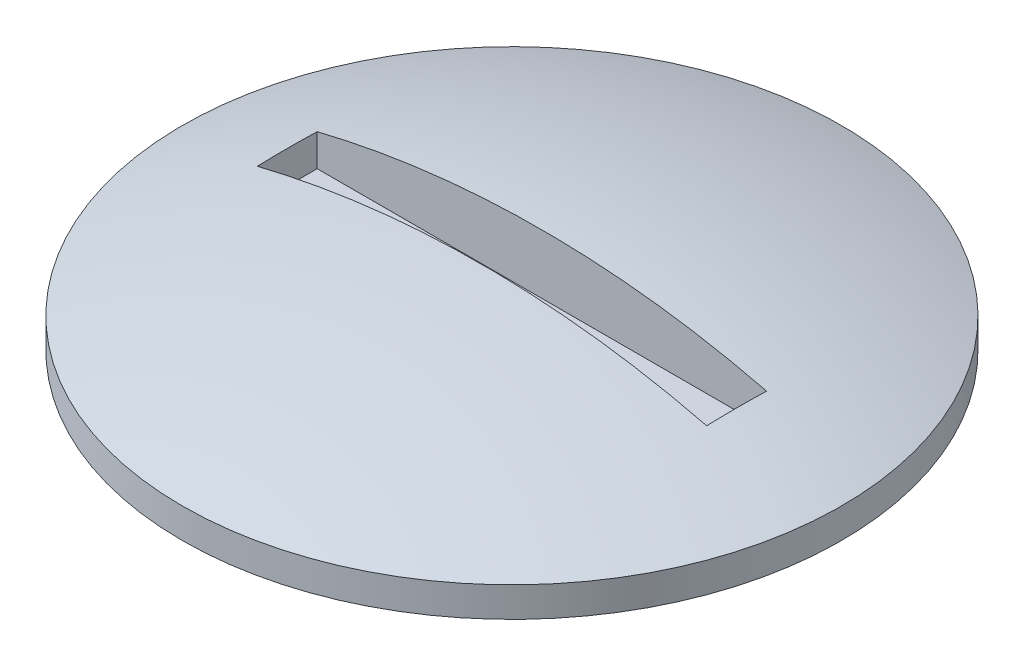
ISO-10303-21;
HEADER;
FILE_DESCRIPTION(('STEP AP214'),'2;1');
FILE_NAME('part.step','',(''),(''),'','','');
FILE_SCHEMA(('AUTOMOTIVE_DESIGN { 1 0 10303 214 1 1 1 1 }'));
ENDSEC;
DATA;
#1=APPLICATION_CONTEXT('core data for automotive mechanical design processes');
#2=APPLICATION_PROTOCOL_DEFINITION('international standard','automotive_design',2000,#1);
#3=PRODUCT_CONTEXT('',#1,'mechanical');
#4=PRODUCT('Part','Part','',(#3));
#5=PRODUCT_RELATED_PRODUCT_CATEGORY('part','',(#4));
#6=PRODUCT_DEFINITION_FORMATION('','',#4);
#7=PRODUCT_DEFINITION_CONTEXT('part definition',#1,'design');
#8=PRODUCT_DEFINITION('design','',#6,#7);
#9=PRODUCT_DEFINITION_SHAPE('','',#8);
#10=(LENGTH_UNIT() NAMED_UNIT(*) SI_UNIT(.MILLI.,.METRE.));
#11=(NAMED_UNIT(*) PLANE_ANGLE_UNIT() SI_UNIT($,.RADIAN.));
#12=(NAMED_UNIT(*) SI_UNIT($,.STERADIAN.) SOLID_ANGLE_UNIT());
#13=UNCERTAINTY_MEASURE_WITH_UNIT(LENGTH_MEASURE(1.E-05),#10,'distance_accuracy_value','');
#14=(GEOMETRIC_REPRESENTATION_CONTEXT(3) GLOBAL_UNCERTAINTY_ASSIGNED_CONTEXT((#13)) GLOBAL_UNIT_ASSIGNED_CONTEXT((#10,
#11,#12)) REPRESENTATION_CONTEXT('',''));
#15=CARTESIAN_POINT('',(0.,0.,0.));
#16=DIRECTION('',(0.,0.,1.));
#17=DIRECTION('',(1.,0.,0.));
#18=AXIS2_PLACEMENT_3D('',#15,#16,#17);
#19=CARTESIAN_POINT('',(373.5,32.,123.));
#20=DIRECTION('',(0.,-1.,0.));
#21=DIRECTION('',(0.,0.,-1.));
#22=AXIS2_PLACEMENT_3D('',#19,#20,#21);
#23=PLANE('',#22);
#24=CARTESIAN_POINT('',(368.,32.,123.));
#25=DIRECTION('',(0.,1.,0.));
#26=DIRECTION('',(0.,0.,1.));
#27=AXIS2_PLACEMENT_3D('',#24,#25,#26);
#28=CIRCLE('',#27,11.);
#29=CARTESIAN_POINT('',(368.,32.,134.));
#30=VERTEX_POINT('',#29);
#31=EDGE_CURVE('E67',#30,#30,#28,.T.);
#32=ORIENTED_EDGE('',*,*,#31,.F.);
#33=EDGE_LOOP('',(#32));
#34=FACE_BOUND('',#33,.T.);
#35=ADVANCED_FACE('F16',(#34),#23,.T.);
#36=CARTESIAN_POINT('',(368.,32.,123.));
#37=DIRECTION('',(0.,1.,0.));
#38=DIRECTION('',(0.,0.,1.));
#39=AXIS2_PLACEMENT_3D('',#36,#37,#38);
#40=CYLINDRICAL_SURFACE('',#39,11.);
#41=ORIENTED_EDGE('',*,*,#31,.T.);
#42=EDGE_LOOP('',(#41));
#43=FACE_BOUND('',#42,.T.);
#44=CARTESIAN_POINT('',(368.,33.,123.));
#45=DIRECTION('',(0.,1.,0.));
#46=DIRECTION('',(0.,0.,1.));
#47=AXIS2_PLACEMENT_3D('',#44,#45,#46);
#48=CIRCLE('',#47,11.);
#49=CARTESIAN_POINT('',(368.,33.,134.));
#50=VERTEX_POINT('',#49);
#51=EDGE_CURVE('E66',#50,#50,#48,.T.);
#52=ORIENTED_EDGE('',*,*,#51,.F.);
#53=EDGE_LOOP('',(#52));
#54=FACE_BOUND('',#53,.T.);
#55=ADVANCED_FACE('F137',(#43,#54),#40,.T.);
#56=CARTESIAN_POINT('',(368.,34.5,124.));
#57=DIRECTION('',(0.,0.,-1.));
#58=DIRECTION('',(-1.,0.,0.));
#59=AXIS2_PLACEMENT_3D('',#56,#57,#58);
#60=PLANE('',#59);
#61=DIRECTION('',(1.,0.,0.));
#62=VECTOR('',#61,1.);
#63=CARTESIAN_POINT('',(368.,33.,124.));
#64=LINE('',#63,#62);
#65=CARTESIAN_POINT('',(360.5,33.,124.));
#66=VERTEX_POINT('',#65);
#67=CARTESIAN_POINT('',(375.5,33.,124.));
#68=VERTEX_POINT('',#67);
#69=EDGE_CURVE('E75',#66,#68,#64,.T.);
#70=ORIENTED_EDGE('',*,*,#69,.F.);
#71=DIRECTION('',(0.,1.,0.));
#72=VECTOR('',#71,1.);
#73=CARTESIAN_POINT('',(360.5,34.5,124.));
#74=LINE('',#73,#72);
#75=CARTESIAN_POINT('',(360.5,34.0701665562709,124.));
#76=VERTEX_POINT('',#75);
#77=EDGE_CURVE('E63',#76,#66,#74,.F.);
#78=ORIENTED_EDGE('',*,*,#77,.F.);
#79=CARTESIAN_POINT('',(375.5,34.0701665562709,124.));
#80=CARTESIAN_POINT('',(374.926135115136,34.2121377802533,124.));
#81=CARTESIAN_POINT('',(374.348233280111,34.3377791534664,124.));
#82=CARTESIAN_POINT('',(373.18603463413,34.5561184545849,124.));
#83=CARTESIAN_POINT('',(372.601735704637,34.6488051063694,124.));
#84=CARTESIAN_POINT('',(371.428717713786,34.8008665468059,124.));
#85=CARTESIAN_POINT('',(370.839997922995,34.860235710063,124.));
#86=CARTESIAN_POINT('',(369.671911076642,34.9446021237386,124.));
#87=CARTESIAN_POINT('',(369.092591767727,34.9702615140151,124.));
#88=CARTESIAN_POINT('',(367.933563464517,34.9893014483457,124.));
#89=CARTESIAN_POINT('',(367.353854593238,34.9826895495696,124.));
#90=CARTESIAN_POINT('',(366.195931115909,34.9372307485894,124.));
#91=CARTESIAN_POINT('',(365.617715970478,34.8983978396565,124.));
#92=CARTESIAN_POINT('',(364.660235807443,34.807283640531,124.));
#93=CARTESIAN_POINT('',(364.280085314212,34.7640466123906,124.));
#94=CARTESIAN_POINT('',(363.521696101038,34.6636468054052,124.));
#95=CARTESIAN_POINT('',(363.143457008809,34.6064868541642,124.));
#96=CARTESIAN_POINT('',(362.38595719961,34.4777387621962,124.));
#97=CARTESIAN_POINT('',(362.006717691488,34.40602594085,124.));
#98=CARTESIAN_POINT('',(361.251078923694,34.2485834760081,124.));
#99=CARTESIAN_POINT('',(360.874680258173,34.1628509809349,124.));
#100=CARTESIAN_POINT('',(360.5,34.0701665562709,124.));
#101=B_SPLINE_CURVE_WITH_KNOTS('',3,(#79,#80,#81,#82,#83,#84,#85,#86,#87,#88,#89,#90,#91,#92,
#93,#94,#95,#96,#97,#98,#99,#100),.UNSPECIFIED.,.F.,.F.,(4,2,2,2,2,2,2,2,2,2,4),(0.,
1.77325445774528,3.54711508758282,5.32127512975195,7.06003794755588,8.79839360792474,
10.5359947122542,11.6835647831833,12.8309019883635,13.9885187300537,15.1463712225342),.UNSPECIFIED.);
#102=CARTESIAN_POINT('',(375.5,34.0701665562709,124.));
#103=VERTEX_POINT('',#102);
#104=EDGE_CURVE('E57',#103,#76,#101,.T.);
#105=ORIENTED_EDGE('',*,*,#104,.F.);
#106=DIRECTION('',(0.,1.,0.));
#107=VECTOR('',#106,1.);
#108=CARTESIAN_POINT('',(375.5,34.5,124.));
#109=LINE('',#108,#107);
#110=EDGE_CURVE('E62',#68,#103,#109,.T.);
#111=ORIENTED_EDGE('',*,*,#110,.F.);
#112=EDGE_LOOP('',(#70,#78,#105,#111));
#113=FACE_BOUND('',#112,.T.);
#114=ADVANCED_FACE('F60',(#113),#60,.T.);
#115=CARTESIAN_POINT('',(368.,3.74999999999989,123.));
#116=DIRECTION('',(1.,0.,0.));
#117=DIRECTION('',(0.,1.,0.));
#118=AXIS2_PLACEMENT_3D('',#115,#116,#117);
#119=SPHERICAL_SURFACE('',#118,31.2500000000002);
#120=ORIENTED_EDGE('',*,*,#51,.T.);
#121=EDGE_LOOP('',(#120));
#122=FACE_BOUND('',#121,.T.);
#123=CARTESIAN_POINT('',(375.5,34.0701665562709,122.));
#124=CARTESIAN_POINT('',(374.926135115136,34.2121377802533,122.));
#125=CARTESIAN_POINT('',(374.348233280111,34.3377791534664,122.));
#126=CARTESIAN_POINT('',(373.18603463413,34.5561184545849,122.));
#127=CARTESIAN_POINT('',(372.601735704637,34.6488051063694,122.));
#128=CARTESIAN_POINT('',(371.428717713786,34.8008665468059,122.));
#129=CARTESIAN_POINT('',(370.839997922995,34.860235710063,122.));
#130=CARTESIAN_POINT('',(369.671911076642,34.9446021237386,122.));
#131=CARTESIAN_POINT('',(369.092591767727,34.9702615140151,122.));
#132=CARTESIAN_POINT('',(367.933563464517,34.9893014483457,122.));
#133=CARTESIAN_POINT('',(367.353854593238,34.9826895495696,122.));
#134=CARTESIAN_POINT('',(366.195931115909,34.9372307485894,122.));
#135=CARTESIAN_POINT('',(365.617715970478,34.8983978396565,122.));
#136=CARTESIAN_POINT('',(364.660235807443,34.807283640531,122.));
#137=CARTESIAN_POINT('',(364.280085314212,34.7640466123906,122.));
#138=CARTESIAN_POINT('',(363.521696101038,34.6636468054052,122.));
#139=CARTESIAN_POINT('',(363.143457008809,34.6064868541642,122.));
#140=CARTESIAN_POINT('',(362.38595719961,34.4777387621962,122.));
#141=CARTESIAN_POINT('',(362.006717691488,34.40602594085,122.));
#142=CARTESIAN_POINT('',(361.251078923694,34.2485834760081,122.));
#143=CARTESIAN_POINT('',(360.874680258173,34.1628509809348,122.));
#144=CARTESIAN_POINT('',(360.5,34.0701665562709,122.));
#145=B_SPLINE_CURVE_WITH_KNOTS('',3,(#123,#124,#125,#126,#127,#128,#129,#130,#131,#132,#133,
#134,#135,#136,#137,#138,#139,#140,#141,#142,#143,#144),.UNSPECIFIED.,.F.,.F.,(4,2,2,2,2,2,2,2,
2,2,4),(0.,1.77325445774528,3.54711508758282,5.32127512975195,7.06003794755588,8.79839360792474,
10.5359947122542,11.6835647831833,12.8309019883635,13.9885187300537,15.1463712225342),.UNSPECIFIED.);
#146=CARTESIAN_POINT('',(375.5,34.0701665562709,122.));
#147=VERTEX_POINT('',#146);
#148=CARTESIAN_POINT('',(360.5,34.0701665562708,122.));
#149=VERTEX_POINT('',#148);
#150=EDGE_CURVE('E73',#147,#149,#145,.T.);
#151=ORIENTED_EDGE('',*,*,#150,.F.);
#152=CARTESIAN_POINT('',(375.5,3.74999999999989,123.));
#153=DIRECTION('',(1.,0.,0.));
#154=DIRECTION('',(0.,0.,-1.));
#155=AXIS2_PLACEMENT_3D('',#152,#153,#154);
#156=CIRCLE('',#155,30.3366527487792);
#157=EDGE_CURVE('E70',#103,#147,#156,.F.);
#158=ORIENTED_EDGE('',*,*,#157,.F.);
#159=ORIENTED_EDGE('',*,*,#104,.T.);
#160=CARTESIAN_POINT('',(360.5,3.74999999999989,123.));
#161=DIRECTION('',(1.,0.,0.));
#162=DIRECTION('',(0.,0.,-1.));
#163=AXIS2_PLACEMENT_3D('',#160,#161,#162);
#164=CIRCLE('',#163,30.3366527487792);
#165=EDGE_CURVE('E124',#149,#76,#164,.T.);
#166=ORIENTED_EDGE('',*,*,#165,.F.);
#167=EDGE_LOOP('',(#151,#158,#159,#166));
#168=FACE_BOUND('',#167,.T.);
#169=ADVANCED_FACE('F71',(#122,#168),#119,.T.);
#170=CARTESIAN_POINT('',(360.5,34.5,123.));
#171=DIRECTION('',(1.,0.,0.));
#172=DIRECTION('',(0.,0.,-1.));
#173=AXIS2_PLACEMENT_3D('',#170,#171,#172);
#174=PLANE('',#173);
#175=DIRECTION('',(0.,0.,1.));
#176=VECTOR('',#175,1.);
#177=CARTESIAN_POINT('',(360.5,33.,123.));
#178=LINE('',#177,#176);
#179=CARTESIAN_POINT('',(360.5,33.,122.));
#180=VERTEX_POINT('',#179);
#181=EDGE_CURVE('E100',#180,#66,#178,.T.);
#182=ORIENTED_EDGE('',*,*,#181,.F.);
#183=DIRECTION('',(0.,1.,0.));
#184=VECTOR('',#183,1.);
#185=CARTESIAN_POINT('',(360.5,34.5,122.));
#186=LINE('',#185,#184);
#187=EDGE_CURVE('E79',#149,#180,#186,.F.);
#188=ORIENTED_EDGE('',*,*,#187,.F.);
#189=ORIENTED_EDGE('',*,*,#165,.T.);
#190=ORIENTED_EDGE('',*,*,#77,.T.);
#191=EDGE_LOOP('',(#182,#188,#189,#190));
#192=FACE_BOUND('',#191,.T.);
#193=ADVANCED_FACE('F117',(#192),#174,.T.);
#194=CARTESIAN_POINT('',(368.,33.,123.));
#195=DIRECTION('',(0.,1.,0.));
#196=DIRECTION('',(0.,0.,1.));
#197=AXIS2_PLACEMENT_3D('',#194,#195,#196);
#198=PLANE('',#197);
#199=ORIENTED_EDGE('',*,*,#181,.T.);
#200=ORIENTED_EDGE('',*,*,#69,.T.);
#201=DIRECTION('',(0.,0.,1.));
#202=VECTOR('',#201,1.);
#203=CARTESIAN_POINT('',(375.5,33.,123.));
#204=LINE('',#203,#202);
#205=CARTESIAN_POINT('',(375.5,33.,122.));
#206=VERTEX_POINT('',#205);
#207=EDGE_CURVE('E36',#206,#68,#204,.T.);
#208=ORIENTED_EDGE('',*,*,#207,.F.);
#209=DIRECTION('',(1.,0.,0.));
#210=VECTOR('',#209,1.);
#211=CARTESIAN_POINT('',(368.,33.,122.));
#212=LINE('',#211,#210);
#213=EDGE_CURVE('E27',#180,#206,#212,.T.);
#214=ORIENTED_EDGE('',*,*,#213,.F.);
#215=EDGE_LOOP('',(#199,#200,#208,#214));
#216=FACE_BOUND('',#215,.T.);
#217=ADVANCED_FACE('F151',(#216),#198,.T.);
#218=CARTESIAN_POINT('',(375.5,34.5,123.));
#219=DIRECTION('',(-1.,0.,0.));
#220=DIRECTION('',(0.,0.,1.));
#221=AXIS2_PLACEMENT_3D('',#218,#219,#220);
#222=PLANE('',#221);
#223=ORIENTED_EDGE('',*,*,#207,.T.);
#224=ORIENTED_EDGE('',*,*,#110,.T.);
#225=ORIENTED_EDGE('',*,*,#157,.T.);
#226=DIRECTION('',(0.,1.,0.));
#227=VECTOR('',#226,1.);
#228=CARTESIAN_POINT('',(375.5,34.5,122.));
#229=LINE('',#228,#227);
#230=EDGE_CURVE('E11',#206,#147,#229,.T.);
#231=ORIENTED_EDGE('',*,*,#230,.F.);
#232=EDGE_LOOP('',(#223,#224,#225,#231));
#233=FACE_BOUND('',#232,.T.);
#234=ADVANCED_FACE('F77',(#233),#222,.T.);
#235=CARTESIAN_POINT('',(368.,34.5,122.));
#236=DIRECTION('',(0.,0.,1.));
#237=DIRECTION('',(1.,0.,0.));
#238=AXIS2_PLACEMENT_3D('',#235,#236,#237);
#239=PLANE('',#238);
#240=ORIENTED_EDGE('',*,*,#213,.T.);
#241=ORIENTED_EDGE('',*,*,#230,.T.);
#242=ORIENTED_EDGE('',*,*,#150,.T.);
#243=ORIENTED_EDGE('',*,*,#187,.T.);
#244=EDGE_LOOP('',(#240,#241,#242,#243));
#245=FACE_BOUND('',#244,.T.);
#246=ADVANCED_FACE('F18',(#245),#239,.T.);
#247=CLOSED_SHELL('',(#35,#55,#114,#169,#193,#217,#234,#246));
#248=MANIFOLD_SOLID_BREP('B1',#247);
#249=ADVANCED_BREP_SHAPE_REPRESENTATION('',(#18,#248),#14);
#250=SHAPE_DEFINITION_REPRESENTATION(#9,#249);
ENDSEC;
END-ISO-10303-21;
